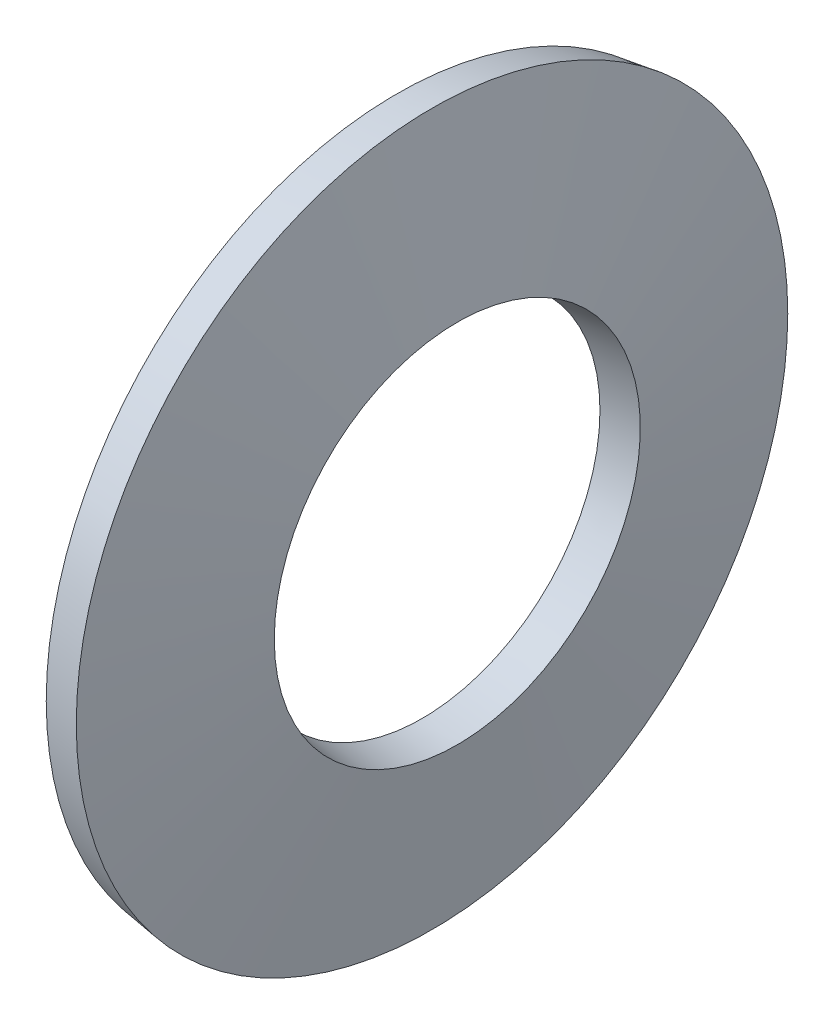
ISO-10303-21;
HEADER;
FILE_DESCRIPTION(('STEP AP214'),'2;1');
FILE_NAME('part.step','',(''),(''),'','','');
FILE_SCHEMA(('AUTOMOTIVE_DESIGN { 1 0 10303 214 1 1 1 1 }'));
ENDSEC;
DATA;
#1=APPLICATION_CONTEXT('core data for automotive mechanical design processes');
#2=APPLICATION_PROTOCOL_DEFINITION('international standard','automotive_design',2000,#1);
#3=PRODUCT_CONTEXT('',#1,'mechanical');
#4=PRODUCT('Part','Part','',(#3));
#5=PRODUCT_RELATED_PRODUCT_CATEGORY('part','',(#4));
#6=PRODUCT_DEFINITION_FORMATION('','',#4);
#7=PRODUCT_DEFINITION_CONTEXT('part definition',#1,'design');
#8=PRODUCT_DEFINITION('design','',#6,#7);
#9=PRODUCT_DEFINITION_SHAPE('','',#8);
#10=(LENGTH_UNIT() NAMED_UNIT(*) SI_UNIT(.MILLI.,.METRE.));
#11=(NAMED_UNIT(*) PLANE_ANGLE_UNIT() SI_UNIT($,.RADIAN.));
#12=(NAMED_UNIT(*) SI_UNIT($,.STERADIAN.) SOLID_ANGLE_UNIT());
#13=UNCERTAINTY_MEASURE_WITH_UNIT(LENGTH_MEASURE(1.E-05),#10,'distance_accuracy_value','');
#14=(GEOMETRIC_REPRESENTATION_CONTEXT(3) GLOBAL_UNCERTAINTY_ASSIGNED_CONTEXT((#13)) GLOBAL_UNIT_ASSIGNED_CONTEXT((#10,
#11,#12)) REPRESENTATION_CONTEXT('',''));
#15=CARTESIAN_POINT('',(0.,0.,0.));
#16=DIRECTION('',(0.,0.,1.));
#17=DIRECTION('',(1.,0.,0.));
#18=AXIS2_PLACEMENT_3D('',#15,#16,#17);
#19=CARTESIAN_POINT('',(1.97892077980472,0.,0.));
#20=DIRECTION('',(1.,0.,0.));
#21=DIRECTION('',(0.,0.,-1.00000000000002));
#22=AXIS2_PLACEMENT_3D('',#19,#20,#21);
#23=CONICAL_SURFACE('',#22,20.,0.1453146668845);
#24=CARTESIAN_POINT('',(0.,0.,0.));
#25=DIRECTION('',(-1.,0.,0.));
#26=DIRECTION('',(0.,0.,1.00000000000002));
#27=AXIS2_PLACEMENT_3D('',#24,#25,#26);
#28=CIRCLE('',#27,19.710392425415);
#29=CARTESIAN_POINT('',(0.,0.,19.7103924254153));
#30=VERTEX_POINT('',#29);
#31=EDGE_CURVE('E10',#30,#30,#28,.T.);
#32=ORIENTED_EDGE('',*,*,#31,.F.);
#33=EDGE_LOOP('',(#32));
#34=FACE_BOUND('',#33,.T.);
#35=CARTESIAN_POINT('',(1.97892077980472,0.,0.));
#36=DIRECTION('',(-1.,0.,0.));
#37=DIRECTION('',(0.,0.,1.00000000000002));
#38=AXIS2_PLACEMENT_3D('',#35,#36,#37);
#39=CIRCLE('',#38,20.);
#40=CARTESIAN_POINT('',(1.97892077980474,0.,20.0000000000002));
#41=VERTEX_POINT('',#40);
#42=EDGE_CURVE('E44',#41,#41,#39,.T.);
#43=ORIENTED_EDGE('',*,*,#42,.T.);
#44=EDGE_LOOP('',(#43));
#45=FACE_BOUND('',#44,.T.);
#46=ADVANCED_FACE('F30',(#34,#45),#23,.T.);
#47=CARTESIAN_POINT('',(0.,0.,0.));
#48=DIRECTION('',(-1.,0.,0.));
#49=DIRECTION('',(0.,0.,1.00000000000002));
#50=AXIS2_PLACEMENT_3D('',#47,#48,#49);
#51=CONICAL_SURFACE('',#50,19.710392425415,1.4254816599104);
#52=CARTESIAN_POINT('',(1.42107922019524,0.,-1.11022302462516E-13));
#53=DIRECTION('',(-1.,0.,0.));
#54=DIRECTION('',(0.,0.,1.00000000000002));
#55=AXIS2_PLACEMENT_3D('',#52,#53,#54);
#56=CIRCLE('',#55,10.);
#57=CARTESIAN_POINT('',(1.42107922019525,0.,10.));
#58=VERTEX_POINT('',#57);
#59=EDGE_CURVE('E36',#58,#58,#56,.T.);
#60=ORIENTED_EDGE('',*,*,#59,.F.);
#61=EDGE_LOOP('',(#60));
#62=FACE_BOUND('',#61,.T.);
#63=ORIENTED_EDGE('',*,*,#31,.T.);
#64=EDGE_LOOP('',(#63));
#65=FACE_BOUND('',#64,.T.);
#66=ADVANCED_FACE('F59',(#62,#65),#51,.F.);
#67=CARTESIAN_POINT('',(1.42107922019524,0.,-1.11022302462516E-13));
#68=DIRECTION('',(1.,0.,0.));
#69=DIRECTION('',(0.,0.,-1.00000000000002));
#70=AXIS2_PLACEMENT_3D('',#67,#68,#69);
#71=CONICAL_SURFACE('',#70,10.,0.145314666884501);
#72=CARTESIAN_POINT('',(3.40000000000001,0.,0.));
#73=DIRECTION('',(-1.,0.,0.));
#74=DIRECTION('',(0.,0.,1.00000000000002));
#75=AXIS2_PLACEMENT_3D('',#72,#73,#74);
#76=CIRCLE('',#75,10.289607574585);
#77=CARTESIAN_POINT('',(3.40000000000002,1.02517840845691E-13,10.2896075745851));
#78=VERTEX_POINT('',#77);
#79=EDGE_CURVE('E40',#78,#78,#76,.T.);
#80=ORIENTED_EDGE('',*,*,#79,.F.);
#81=EDGE_LOOP('',(#80));
#82=FACE_BOUND('',#81,.T.);
#83=ORIENTED_EDGE('',*,*,#59,.T.);
#84=EDGE_LOOP('',(#83));
#85=FACE_BOUND('',#84,.T.);
#86=ADVANCED_FACE('F54',(#82,#85),#71,.F.);
#87=CARTESIAN_POINT('',(3.40000000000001,0.,0.));
#88=DIRECTION('',(-1.,0.,0.));
#89=DIRECTION('',(0.,0.,1.00000000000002));
#90=AXIS2_PLACEMENT_3D('',#87,#88,#89);
#91=CONICAL_SURFACE('',#90,10.289607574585,1.4254816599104);
#92=ORIENTED_EDGE('',*,*,#42,.F.);
#93=EDGE_LOOP('',(#92));
#94=FACE_BOUND('',#93,.T.);
#95=ORIENTED_EDGE('',*,*,#79,.T.);
#96=EDGE_LOOP('',(#95));
#97=FACE_BOUND('',#96,.T.);
#98=ADVANCED_FACE('F51',(#94,#97),#91,.T.);
#99=CLOSED_SHELL('',(#46,#66,#86,#98));
#100=MANIFOLD_SOLID_BREP('B2',#99);
#101=ADVANCED_BREP_SHAPE_REPRESENTATION('',(#18,#100),#14);
#102=SHAPE_DEFINITION_REPRESENTATION(#9,#101);
ENDSEC;
END-ISO-10303-21;
